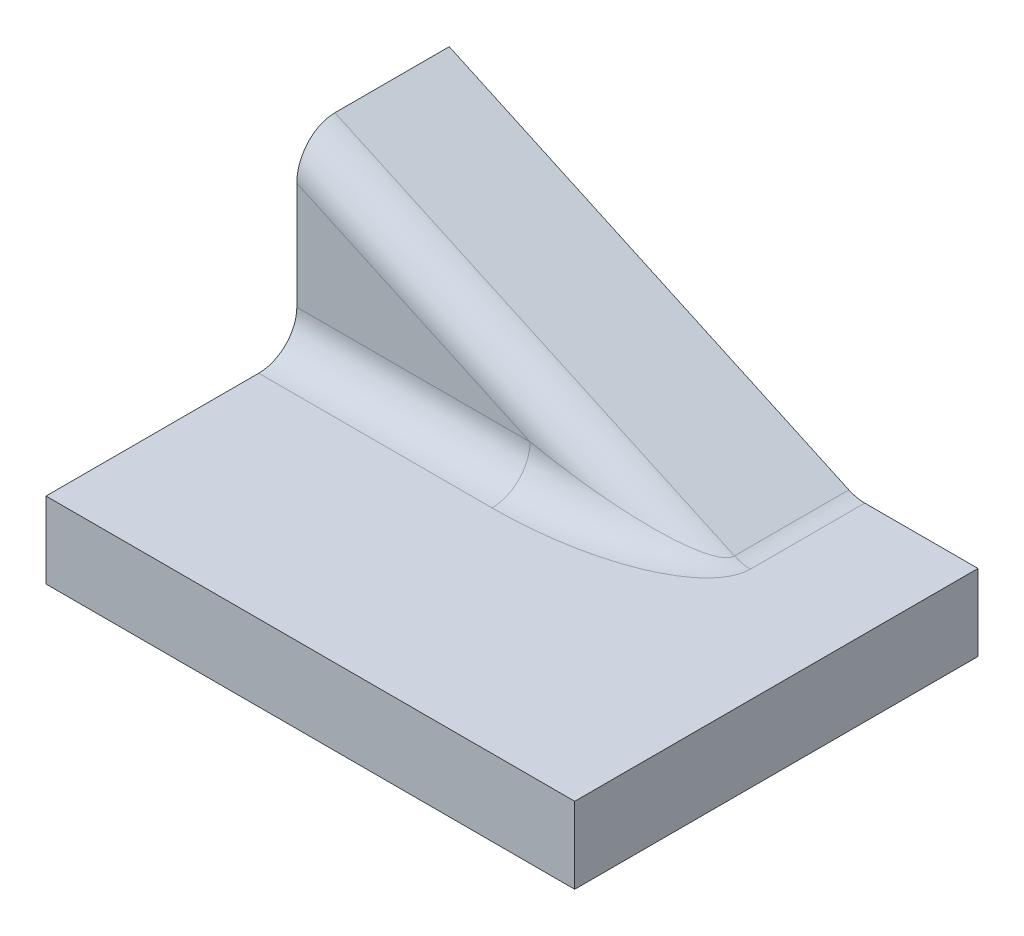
ISO-10303-21;
HEADER;
FILE_DESCRIPTION(('STEP AP214'),'2;1');
FILE_NAME('part.step','',(''),(''),'','','');
FILE_SCHEMA(('AUTOMOTIVE_DESIGN { 1 0 10303 214 1 1 1 1 }'));
ENDSEC;
DATA;
#1=APPLICATION_CONTEXT('core data for automotive mechanical design processes');
#2=APPLICATION_PROTOCOL_DEFINITION('international standard','automotive_design',2000,#1);
#3=PRODUCT_CONTEXT('',#1,'mechanical');
#4=PRODUCT('Part','Part','',(#3));
#5=PRODUCT_RELATED_PRODUCT_CATEGORY('part','',(#4));
#6=PRODUCT_DEFINITION_FORMATION('','',#4);
#7=PRODUCT_DEFINITION_CONTEXT('part definition',#1,'design');
#8=PRODUCT_DEFINITION('design','',#6,#7);
#9=PRODUCT_DEFINITION_SHAPE('','',#8);
#10=(LENGTH_UNIT() NAMED_UNIT(*) SI_UNIT(.MILLI.,.METRE.));
#11=(NAMED_UNIT(*) PLANE_ANGLE_UNIT() SI_UNIT($,.RADIAN.));
#12=(NAMED_UNIT(*) SI_UNIT($,.STERADIAN.) SOLID_ANGLE_UNIT());
#13=UNCERTAINTY_MEASURE_WITH_UNIT(LENGTH_MEASURE(1.E-05),#10,'distance_accuracy_value','');
#14=(GEOMETRIC_REPRESENTATION_CONTEXT(3) GLOBAL_UNCERTAINTY_ASSIGNED_CONTEXT((#13)) GLOBAL_UNIT_ASSIGNED_CONTEXT((#10,
#11,#12)) REPRESENTATION_CONTEXT('',''));
#15=CARTESIAN_POINT('',(0.,0.,0.));
#16=DIRECTION('',(0.,0.,1.));
#17=DIRECTION('',(1.,0.,0.));
#18=AXIS2_PLACEMENT_3D('',#15,#16,#17);
#19=CARTESIAN_POINT('',(0.,25.4,0.));
#20=DIRECTION('',(0.,-1.,0.));
#21=DIRECTION('',(0.,0.,-1.));
#22=AXIS2_PLACEMENT_3D('',#19,#20,#21);
#23=PLANE('',#22);
#24=DIRECTION('',(-1.,0.,0.));
#25=VECTOR('',#24,1.);
#26=CARTESIAN_POINT('',(-88.0843898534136,25.4,-67.1830092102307));
#27=LINE('',#26,#25);
#28=CARTESIAN_POINT('',(88.0843898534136,25.4,-67.1830092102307));
#29=VERTEX_POINT('',#28);
#30=CARTESIAN_POINT('',(50.3632623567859,25.4,-67.1830092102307));
#31=VERTEX_POINT('',#30);
#32=EDGE_CURVE('E161',#29,#31,#27,.T.);
#33=ORIENTED_EDGE('',*,*,#32,.T.);
#34=DIRECTION('',(0.,0.,-1.));
#35=VECTOR('',#34,1.);
#36=CARTESIAN_POINT('',(50.363262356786,25.4,0.));
#37=LINE('',#36,#35);
#38=CARTESIAN_POINT('',(50.363262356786,25.4,-29.0830092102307));
#39=VERTEX_POINT('',#38);
#40=EDGE_CURVE('E201',#31,#39,#37,.F.);
#41=ORIENTED_EDGE('',*,*,#40,.T.);
#42=CARTESIAN_POINT('',(-10.3596540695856,25.4,-29.0830092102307));
#43=DIRECTION('',(0.,-1.,0.));
#44=DIRECTION('',(-1.,0.,0.));
#45=AXIS2_PLACEMENT_3D('',#42,#43,#44);
#46=ELLIPSE('',#45,60.7229164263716,25.4);
#47=CARTESIAN_POINT('',(-10.3596540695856,25.4,-3.68300921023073));
#48=VERTEX_POINT('',#47);
#49=EDGE_CURVE('E205',#39,#48,#46,.T.);
#50=ORIENTED_EDGE('',*,*,#49,.T.);
#51=DIRECTION('',(-1.,0.,0.));
#52=VECTOR('',#51,1.);
#53=CARTESIAN_POINT('',(-88.0843898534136,25.4,-3.68300921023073));
#54=LINE('',#53,#52);
#55=CARTESIAN_POINT('',(-88.0843898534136,25.4,-3.68300921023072));
#56=VERTEX_POINT('',#55);
#57=EDGE_CURVE('E156',#48,#56,#54,.T.);
#58=ORIENTED_EDGE('',*,*,#57,.T.);
#59=DIRECTION('',(0.,0.,1.));
#60=VECTOR('',#59,1.);
#61=CARTESIAN_POINT('',(-88.0843898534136,25.4,67.1830092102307));
#62=LINE('',#61,#60);
#63=CARTESIAN_POINT('',(-88.0843898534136,25.4,67.1830092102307));
#64=VERTEX_POINT('',#63);
#65=EDGE_CURVE('E157',#56,#64,#62,.T.);
#66=ORIENTED_EDGE('',*,*,#65,.T.);
#67=DIRECTION('',(1.,0.,0.));
#68=VECTOR('',#67,1.);
#69=CARTESIAN_POINT('',(-88.0843898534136,25.4,67.1830092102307));
#70=LINE('',#69,#68);
#71=CARTESIAN_POINT('',(88.0843898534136,25.4,67.1830092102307));
#72=VERTEX_POINT('',#71);
#73=EDGE_CURVE('E160',#64,#72,#70,.T.);
#74=ORIENTED_EDGE('',*,*,#73,.T.);
#75=DIRECTION('',(0.,0.,-1.));
#76=VECTOR('',#75,1.);
#77=CARTESIAN_POINT('',(88.0843898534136,25.4,67.1830092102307));
#78=LINE('',#77,#76);
#79=EDGE_CURVE('E177',#72,#29,#78,.T.);
#80=ORIENTED_EDGE('',*,*,#79,.T.);
#81=EDGE_LOOP('',(#33,#41,#50,#58,#66,#74,#80));
#82=FACE_BOUND('',#81,.T.);
#83=ADVANCED_FACE('F36',(#82),#23,.F.);
#84=CARTESIAN_POINT('',(88.0843898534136,25.4,67.1830092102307));
#85=DIRECTION('',(-1.,0.,0.));
#86=DIRECTION('',(0.,0.,1.));
#87=AXIS2_PLACEMENT_3D('',#84,#85,#86);
#88=PLANE('',#87);
#89=DIRECTION('',(0.,0.,-1.));
#90=VECTOR('',#89,1.);
#91=CARTESIAN_POINT('',(88.0843898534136,0.,67.1830092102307));
#92=LINE('',#91,#90);
#93=CARTESIAN_POINT('',(88.0843898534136,0.,67.1830092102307));
#94=VERTEX_POINT('',#93);
#95=CARTESIAN_POINT('',(88.0843898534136,0.,-67.1830092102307));
#96=VERTEX_POINT('',#95);
#97=EDGE_CURVE('E123',#94,#96,#92,.T.);
#98=ORIENTED_EDGE('',*,*,#97,.T.);
#99=DIRECTION('',(0.,-1.,0.));
#100=VECTOR('',#99,1.);
#101=CARTESIAN_POINT('',(88.0843898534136,25.4,-67.1830092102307));
#102=LINE('',#101,#100);
#103=EDGE_CURVE('E132',#29,#96,#102,.T.);
#104=ORIENTED_EDGE('',*,*,#103,.F.);
#105=ORIENTED_EDGE('',*,*,#79,.F.);
#106=DIRECTION('',(0.,-1.,0.));
#107=VECTOR('',#106,1.);
#108=CARTESIAN_POINT('',(88.0843898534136,25.4,67.1830092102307));
#109=LINE('',#108,#107);
#110=EDGE_CURVE('E169',#72,#94,#109,.T.);
#111=ORIENTED_EDGE('',*,*,#110,.T.);
#112=EDGE_LOOP('',(#98,#104,#105,#111));
#113=FACE_BOUND('',#112,.T.);
#114=ADVANCED_FACE('F191',(#113),#88,.F.);
#115=CARTESIAN_POINT('',(-88.0843898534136,25.4,-67.1830092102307));
#116=DIRECTION('',(0.,0.,1.));
#117=DIRECTION('',(1.,0.,0.));
#118=AXIS2_PLACEMENT_3D('',#115,#116,#117);
#119=PLANE('',#118);
#120=DIRECTION('',(-1.,0.,0.));
#121=VECTOR('',#120,1.);
#122=CARTESIAN_POINT('',(-88.0843898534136,0.,-67.1830092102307));
#123=LINE('',#122,#121);
#124=CARTESIAN_POINT('',(-88.0843898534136,0.,-67.1830092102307));
#125=VERTEX_POINT('',#124);
#126=EDGE_CURVE('E131',#96,#125,#123,.T.);
#127=ORIENTED_EDGE('',*,*,#126,.T.);
#128=DIRECTION('',(0.,-1.,0.));
#129=VECTOR('',#128,1.);
#130=CARTESIAN_POINT('',(-88.0843898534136,25.4,-67.1830092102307));
#131=LINE('',#130,#129);
#132=CARTESIAN_POINT('',(-88.0843898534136,87.8755766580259,-67.1830092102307));
#133=VERTEX_POINT('',#132);
#134=EDGE_CURVE('E115',#133,#125,#131,.T.);
#135=ORIENTED_EDGE('',*,*,#134,.F.);
#136=DIRECTION('',(0.908311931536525,-0.418293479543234,0.));
#137=VECTOR('',#136,1.);
#138=CARTESIAN_POINT('',(47.5794788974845,25.4,-67.1830092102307));
#139=LINE('',#138,#137);
#140=CARTESIAN_POINT('',(45.0509351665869,26.5644384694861,-67.1830092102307));
#141=VERTEX_POINT('',#140);
#142=EDGE_CURVE('E129',#133,#141,#139,.T.);
#143=ORIENTED_EDGE('',*,*,#142,.T.);
#144=CARTESIAN_POINT('',(50.363262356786,38.1,-67.1830092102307));
#145=DIRECTION('',(0.,0.,1.));
#146=DIRECTION('',(1.,0.,0.));
#147=AXIS2_PLACEMENT_3D('',#144,#145,#146);
#148=CIRCLE('',#147,12.7);
#149=EDGE_CURVE('E49',#141,#31,#148,.T.);
#150=ORIENTED_EDGE('',*,*,#149,.T.);
#151=ORIENTED_EDGE('',*,*,#32,.F.);
#152=ORIENTED_EDGE('',*,*,#103,.T.);
#153=EDGE_LOOP('',(#127,#135,#143,#150,#151,#152));
#154=FACE_BOUND('',#153,.T.);
#155=ADVANCED_FACE('F128',(#154),#119,.F.);
#156=CARTESIAN_POINT('',(-88.0843898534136,25.4,67.1830092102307));
#157=DIRECTION('',(1.,0.,0.));
#158=DIRECTION('',(0.,0.,-1.));
#159=AXIS2_PLACEMENT_3D('',#156,#157,#158);
#160=PLANE('',#159);
#161=ORIENTED_EDGE('',*,*,#65,.F.);
#162=CARTESIAN_POINT('',(-88.0843898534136,38.1,-3.68300921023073));
#163=DIRECTION('',(1.,0.,0.));
#164=DIRECTION('',(0.,0.,-1.));
#165=AXIS2_PLACEMENT_3D('',#162,#163,#164);
#166=CIRCLE('',#165,12.7);
#167=CARTESIAN_POINT('',(-88.0843898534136,38.1,-16.3830092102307));
#168=VERTEX_POINT('',#167);
#169=EDGE_CURVE('E11',#56,#168,#166,.T.);
#170=ORIENTED_EDGE('',*,*,#169,.T.);
#171=DIRECTION('',(0.,1.,0.));
#172=VECTOR('',#171,1.);
#173=CARTESIAN_POINT('',(-88.0843898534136,87.8755766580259,-16.3830092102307));
#174=LINE('',#173,#172);
#175=CARTESIAN_POINT('',(-88.0843898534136,73.8935958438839,-16.3830092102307));
#176=VERTEX_POINT('',#175);
#177=EDGE_CURVE('E124',#168,#176,#174,.T.);
#178=ORIENTED_EDGE('',*,*,#177,.T.);
#179=CARTESIAN_POINT('',(-88.0843898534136,73.8935958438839,-29.0830092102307));
#180=DIRECTION('',(1.,0.,0.));
#181=DIRECTION('',(0.,1.,0.));
#182=AXIS2_PLACEMENT_3D('',#179,#180,#181);
#183=ELLIPSE('',#182,13.981980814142,12.7);
#184=CARTESIAN_POINT('',(-88.0843898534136,87.8755766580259,-29.0830092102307));
#185=VERTEX_POINT('',#184);
#186=EDGE_CURVE('E118',#176,#185,#183,.F.);
#187=ORIENTED_EDGE('',*,*,#186,.T.);
#188=DIRECTION('',(0.,0.,-1.));
#189=VECTOR('',#188,1.);
#190=CARTESIAN_POINT('',(-88.0843898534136,87.8755766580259,-16.3830092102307));
#191=LINE('',#190,#189);
#192=EDGE_CURVE('E112',#185,#133,#191,.T.);
#193=ORIENTED_EDGE('',*,*,#192,.T.);
#194=ORIENTED_EDGE('',*,*,#134,.T.);
#195=DIRECTION('',(0.,0.,1.));
#196=VECTOR('',#195,1.);
#197=CARTESIAN_POINT('',(-88.0843898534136,0.,67.1830092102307));
#198=LINE('',#197,#196);
#199=CARTESIAN_POINT('',(-88.0843898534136,0.,67.1830092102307));
#200=VERTEX_POINT('',#199);
#201=EDGE_CURVE('E173',#125,#200,#198,.T.);
#202=ORIENTED_EDGE('',*,*,#201,.T.);
#203=DIRECTION('',(0.,-1.,0.));
#204=VECTOR('',#203,1.);
#205=CARTESIAN_POINT('',(-88.0843898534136,25.4,67.1830092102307));
#206=LINE('',#205,#204);
#207=EDGE_CURVE('E133',#64,#200,#206,.T.);
#208=ORIENTED_EDGE('',*,*,#207,.F.);
#209=EDGE_LOOP('',(#161,#170,#178,#187,#193,#194,#202,#208));
#210=FACE_BOUND('',#209,.T.);
#211=ADVANCED_FACE('F114',(#210),#160,.F.);
#212=CARTESIAN_POINT('',(-88.0843898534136,25.4,67.1830092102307));
#213=DIRECTION('',(0.,0.,-1.));
#214=DIRECTION('',(-1.,0.,0.));
#215=AXIS2_PLACEMENT_3D('',#212,#213,#214);
#216=PLANE('',#215);
#217=DIRECTION('',(1.,0.,0.));
#218=VECTOR('',#217,1.);
#219=CARTESIAN_POINT('',(-88.0843898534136,0.,67.1830092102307));
#220=LINE('',#219,#218);
#221=EDGE_CURVE('E175',#200,#94,#220,.T.);
#222=ORIENTED_EDGE('',*,*,#221,.T.);
#223=ORIENTED_EDGE('',*,*,#110,.F.);
#224=ORIENTED_EDGE('',*,*,#73,.F.);
#225=ORIENTED_EDGE('',*,*,#207,.T.);
#226=EDGE_LOOP('',(#222,#223,#224,#225));
#227=FACE_BOUND('',#226,.T.);
#228=ADVANCED_FACE('F217',(#227),#216,.F.);
#229=CARTESIAN_POINT('',(0.,0.,0.));
#230=DIRECTION('',(0.,-1.,0.));
#231=DIRECTION('',(0.,0.,-1.));
#232=AXIS2_PLACEMENT_3D('',#229,#230,#231);
#233=PLANE('',#232);
#234=ORIENTED_EDGE('',*,*,#97,.F.);
#235=ORIENTED_EDGE('',*,*,#221,.F.);
#236=ORIENTED_EDGE('',*,*,#201,.F.);
#237=ORIENTED_EDGE('',*,*,#126,.F.);
#238=EDGE_LOOP('',(#234,#235,#236,#237));
#239=FACE_BOUND('',#238,.T.);
#240=ADVANCED_FACE('F219',(#239),#233,.T.);
#241=CARTESIAN_POINT('',(47.5794788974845,25.4,-16.3830092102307));
#242=DIRECTION('',(0.418293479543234,0.908311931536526,0.));
#243=DIRECTION('',(-0.908311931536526,0.418293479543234,0.));
#244=AXIS2_PLACEMENT_3D('',#241,#242,#243);
#245=PLANE('',#244);
#246=DIRECTION('',(0.908311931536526,-0.418293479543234,0.));
#247=VECTOR('',#246,1.);
#248=CARTESIAN_POINT('',(47.5794788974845,25.4,-29.0830092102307));
#249=LINE('',#248,#247);
#250=CARTESIAN_POINT('',(45.0509351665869,26.5644384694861,-29.0830092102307));
#251=VERTEX_POINT('',#250);
#252=EDGE_CURVE('E150',#185,#251,#249,.T.);
#253=ORIENTED_EDGE('',*,*,#252,.T.);
#254=DIRECTION('',(0.,0.,-1.));
#255=VECTOR('',#254,1.);
#256=CARTESIAN_POINT('',(45.0509351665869,26.5644384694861,-16.3830092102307));
#257=LINE('',#256,#255);
#258=EDGE_CURVE('E138',#251,#141,#257,.T.);
#259=ORIENTED_EDGE('',*,*,#258,.T.);
#260=ORIENTED_EDGE('',*,*,#142,.F.);
#261=ORIENTED_EDGE('',*,*,#192,.F.);
#262=EDGE_LOOP('',(#253,#259,#260,#261));
#263=FACE_BOUND('',#262,.T.);
#264=ADVANCED_FACE('F136',(#263),#245,.T.);
#265=CARTESIAN_POINT('',(0.,0.,-16.3830092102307));
#266=DIRECTION('',(0.,0.,-1.));
#267=DIRECTION('',(-1.,0.,0.));
#268=AXIS2_PLACEMENT_3D('',#265,#266,#267);
#269=PLANE('',#268);
#270=ORIENTED_EDGE('',*,*,#177,.F.);
#271=DIRECTION('',(-1.,0.,0.));
#272=VECTOR('',#271,1.);
#273=CARTESIAN_POINT('',(17.2180206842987,38.1,-16.3830092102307));
#274=LINE('',#273,#272);
#275=CARTESIAN_POINT('',(-10.3596540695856,38.1,-16.3830092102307));
#276=VERTEX_POINT('',#275);
#277=EDGE_CURVE('E62',#168,#276,#274,.F.);
#278=ORIENTED_EDGE('',*,*,#277,.T.);
#279=DIRECTION('',(0.908311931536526,-0.418293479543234,0.));
#280=VECTOR('',#279,1.);
#281=CARTESIAN_POINT('',(-93.3967170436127,76.3400151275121,-16.3830092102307));
#282=LINE('',#281,#280);
#283=EDGE_CURVE('E152',#276,#176,#282,.F.);
#284=ORIENTED_EDGE('',*,*,#283,.T.);
#285=EDGE_LOOP('',(#270,#278,#284));
#286=FACE_BOUND('',#285,.T.);
#287=ADVANCED_FACE('F226',(#286),#269,.F.);
#288=CARTESIAN_POINT('',(42.2671517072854,13.8644384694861,-29.0830092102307));
#289=DIRECTION('',(-0.908311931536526,0.418293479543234,0.));
#290=DIRECTION('',(-0.418293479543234,-0.908311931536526,0.));
#291=AXIS2_PLACEMENT_3D('',#288,#289,#290);
#292=CYLINDRICAL_SURFACE('',#291,12.7);
#293=ORIENTED_EDGE('',*,*,#283,.F.);
#294=CARTESIAN_POINT('',(-10.3596540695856,38.1,-29.0830092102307));
#295=DIRECTION('',(0.203813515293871,0.979009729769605,0.));
#296=DIRECTION('',(-0.979009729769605,0.203813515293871,0.));
#297=AXIS2_PLACEMENT_3D('',#294,#295,#296);
#298=ELLIPSE('',#297,56.5986093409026,12.7);
#299=EDGE_CURVE('E195',#276,#251,#298,.T.);
#300=ORIENTED_EDGE('',*,*,#299,.T.);
#301=ORIENTED_EDGE('',*,*,#252,.F.);
#302=ORIENTED_EDGE('',*,*,#186,.F.);
#303=EDGE_LOOP('',(#293,#300,#301,#302));
#304=FACE_BOUND('',#303,.T.);
#305=ADVANCED_FACE('F211',(#304),#292,.T.);
#306=CARTESIAN_POINT('',(0.,38.1,-3.68300921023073));
#307=DIRECTION('',(1.,0.,0.));
#308=DIRECTION('',(0.,0.,-1.));
#309=AXIS2_PLACEMENT_3D('',#306,#307,#308);
#310=CYLINDRICAL_SURFACE('',#309,12.7);
#311=ORIENTED_EDGE('',*,*,#169,.F.);
#312=ORIENTED_EDGE('',*,*,#57,.F.);
#313=CARTESIAN_POINT('',(-10.3596540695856,38.1,-3.68300921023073));
#314=DIRECTION('',(-1.,0.,0.));
#315=DIRECTION('',(0.,-1.,0.));
#316=AXIS2_PLACEMENT_3D('',#313,#314,#315);
#317=CIRCLE('',#316,12.7);
#318=EDGE_CURVE('E139',#276,#48,#317,.T.);
#319=ORIENTED_EDGE('',*,*,#318,.F.);
#320=ORIENTED_EDGE('',*,*,#277,.F.);
#321=EDGE_LOOP('',(#311,#312,#319,#320));
#322=FACE_BOUND('',#321,.T.);
#323=ADVANCED_FACE('F213',(#322),#310,.F.);
#324=CARTESIAN_POINT('',(-65.0226761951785,49.4799305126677,-27.0038983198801));
#325=CARTESIAN_POINT('',(-56.6353878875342,45.0095108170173,-30.3313636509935));
#326=CARTESIAN_POINT('',(-58.769254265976,35.2047554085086,-29.4848008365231));
#327=CARTESIAN_POINT('',(-60.9031206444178,25.4,-28.6382380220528));
#328=CARTESIAN_POINT('',(-70.2633325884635,25.4,-24.9247874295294));
#329=CARTESIAN_POINT('',(-64.9618233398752,49.4672619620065,-26.9198482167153));
#330=CARTESIAN_POINT('',(-56.6409402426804,44.9817366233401,-30.3592086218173));
#331=CARTESIAN_POINT('',(-58.7705335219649,35.1908619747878,-29.4791893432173));
#332=CARTESIAN_POINT('',(-60.9001237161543,25.4,-28.5991740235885));
#333=CARTESIAN_POINT('',(-70.1966456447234,25.4,-24.7566872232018));
#334=CARTESIAN_POINT('',(-64.8976949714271,49.4539115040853,-26.8365185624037));
#335=CARTESIAN_POINT('',(-56.6453624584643,44.9526591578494,-30.3830992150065));
#336=CARTESIAN_POINT('',(-58.7704726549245,35.1763222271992,-29.4700262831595));
#337=CARTESIAN_POINT('',(-60.8955839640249,25.4,-28.5569652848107));
#338=CARTESIAN_POINT('',(-70.1263691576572,25.4,-24.5900279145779));
#339=CARTESIAN_POINT('',(-64.7632809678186,49.4259287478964,-26.6713818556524));
#340=CARTESIAN_POINT('',(-56.6513090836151,44.8921960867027,-30.4230849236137));
#341=CARTESIAN_POINT('',(-58.7670872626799,35.1460907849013,-29.4447877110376));
#342=CARTESIAN_POINT('',(-60.8828676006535,25.4,-28.4665029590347));
#343=CARTESIAN_POINT('',(-69.9790686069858,25.4,-24.2597545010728));
#344=CARTESIAN_POINT('',(-64.6929965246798,49.4112966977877,-26.5895745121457));
#345=CARTESIAN_POINT('',(-56.6528366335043,44.8608153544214,-30.4391876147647));
#346=CARTESIAN_POINT('',(-58.7637633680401,35.1303993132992,-29.4287135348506));
#347=CARTESIAN_POINT('',(-60.8746956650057,25.4,-28.4182596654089));
#348=CARTESIAN_POINT('',(-69.9020458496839,25.4,-24.0961398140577));
#349=CARTESIAN_POINT('',(-64.5467355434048,49.3808475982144,-26.4276370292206));
#350=CARTESIAN_POINT('',(-56.6523730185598,44.7960581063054,-30.463745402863));
#351=CARTESIAN_POINT('',(-58.7532762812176,35.0980207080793,-29.3898663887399));
#352=CARTESIAN_POINT('',(-60.8541848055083,25.4,-28.3160072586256));
#353=CARTESIAN_POINT('',(-69.7417625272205,25.4,-23.7722648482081));
#354=CARTESIAN_POINT('',(-64.4707665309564,49.3650321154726,-26.3475048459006));
#355=CARTESIAN_POINT('',(-56.6503900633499,44.7626884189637,-30.472217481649));
#356=CARTESIAN_POINT('',(-58.7461180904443,35.0813348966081,-29.3671021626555));
#357=CARTESIAN_POINT('',(-60.8418562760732,25.4,-28.262015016));
#358=CARTESIAN_POINT('',(-69.65851020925,25.4,-23.6120004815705));
#359=CARTESIAN_POINT('',(-64.3134291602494,49.3322770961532,-26.1888487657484));
#360=CARTESIAN_POINT('',(-56.6424318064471,44.6941741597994,-30.4818792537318));
#361=CARTESIAN_POINT('',(-58.7275219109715,35.0470777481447,-29.3152128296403));
#362=CARTESIAN_POINT('',(-60.812622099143,25.4,-28.1485747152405));
#363=CARTESIAN_POINT('',(-69.4860885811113,25.4,-23.2946883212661));
#364=CARTESIAN_POINT('',(-64.232060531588,49.3153375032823,-26.1103249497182));
#365=CARTESIAN_POINT('',(-56.636460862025,44.6590332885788,-30.4830762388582));
#366=CARTESIAN_POINT('',(-58.7160837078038,35.0295063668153,-29.2860874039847));
#367=CARTESIAN_POINT('',(-60.7957219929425,25.4,-28.0891353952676));
#368=CARTESIAN_POINT('',(-69.3969189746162,25.4,-23.1376406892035));
#369=CARTESIAN_POINT('',(-63.9815764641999,49.2631908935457,-25.8783001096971));
#370=CARTESIAN_POINT('',(-56.6120744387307,44.5518787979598,-30.4763693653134));
#371=CARTESIAN_POINT('',(-58.6749828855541,34.9758993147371,-29.1902242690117));
#372=CARTESIAN_POINT('',(-60.7379534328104,25.4,-27.9042223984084));
#373=CARTESIAN_POINT('',(-69.1224204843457,25.4,-22.6735910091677));
#374=CARTESIAN_POINT('',(-63.8050285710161,49.2264365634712,-25.7271897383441));
#375=CARTESIAN_POINT('',(-56.587198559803,44.4775643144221,-30.4583712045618));
#376=CARTESIAN_POINT('',(-58.6384699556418,34.9387361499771,-29.1147109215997));
#377=CARTESIAN_POINT('',(-60.6898539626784,25.4,-27.7712564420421));
#378=CARTESIAN_POINT('',(-68.9289465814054,25.4,-22.3713702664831));
#379=CARTESIAN_POINT('',(-63.4346675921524,49.1493335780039,-25.4314354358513));
#380=CARTESIAN_POINT('',(-56.5181491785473,44.3245388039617,-30.3989478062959));
#381=CARTESIAN_POINT('',(-58.5454264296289,34.8622233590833,-28.9439020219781));
#382=CARTESIAN_POINT('',(-60.5728149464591,25.4,-27.4890614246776));
#383=CARTESIAN_POINT('',(-68.5230783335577,25.4,-21.7798616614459));
#384=CARTESIAN_POINT('',(-63.2408484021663,49.1089836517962,-25.2867938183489));
#385=CARTESIAN_POINT('',(-56.4740195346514,44.2458464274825,-30.3575742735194));
#386=CARTESIAN_POINT('',(-58.4888887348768,34.8228729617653,-28.848599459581));
#387=CARTESIAN_POINT('',(-60.503925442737,25.4,-27.339883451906));
#388=CARTESIAN_POINT('',(-68.310677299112,25.4,-21.4905784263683));
#389=CARTESIAN_POINT('',(-62.8432500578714,49.0262103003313,-25.0073642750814));
#390=CARTESIAN_POINT('',(-56.3671828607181,44.087392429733,-30.2566487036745));
#391=CARTESIAN_POINT('',(-58.3570399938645,34.7436484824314,-28.6446191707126));
#392=CARTESIAN_POINT('',(-60.3470557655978,25.4,-27.0328353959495));
#393=CARTESIAN_POINT('',(-67.8749603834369,25.4,-20.9317193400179));
#394=CARTESIAN_POINT('',(-62.6398317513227,48.9838619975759,-24.8724216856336));
#395=CARTESIAN_POINT('',(-56.3050121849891,44.0077225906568,-30.1976200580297));
#396=CARTESIAN_POINT('',(-58.2822233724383,34.7038109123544,-28.5363267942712));
#397=CARTESIAN_POINT('',(-60.2596455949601,25.4,-26.8753190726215));
#398=CARTESIAN_POINT('',(-67.6520399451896,25.4,-20.6618341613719));
#399=CARTESIAN_POINT('',(-62.2207295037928,48.8966118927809,-24.6084323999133));
#400=CARTESIAN_POINT('',(-56.1619849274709,43.8465002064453,-30.0645646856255));
#401=CARTESIAN_POINT('',(-58.1135710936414,34.6231998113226,-28.3079238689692));
#402=CARTESIAN_POINT('',(-60.0653674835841,25.4,-26.551568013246));
#403=CARTESIAN_POINT('',(-67.1927575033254,25.4,-20.1338555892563));
#404=CARTESIAN_POINT('',(-62.0050470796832,48.8517104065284,-24.4793849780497));
#405=CARTESIAN_POINT('',(-56.0811807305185,43.7649565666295,-29.9905804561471));
#406=CARTESIAN_POINT('',(-58.0197377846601,34.5824263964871,-28.1878147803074));
#407=CARTESIAN_POINT('',(-59.9585552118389,25.4,-26.3853640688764));
#408=CARTESIAN_POINT('',(-66.9563971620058,25.4,-19.8757607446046));
#409=CARTESIAN_POINT('',(-61.5625498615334,48.7595898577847,-24.2266568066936));
#410=CARTESIAN_POINT('',(-55.9014476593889,43.6005770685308,-29.8305318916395));
#411=CARTESIAN_POINT('',(-57.8137020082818,34.5002365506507,-27.9383984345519));
#412=CARTESIAN_POINT('',(-59.726216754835,25.4,-26.0465804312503));
#413=CARTESIAN_POINT('',(-66.4714768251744,25.4,-19.3703044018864));
#414=CARTESIAN_POINT('',(-61.3357130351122,48.7123662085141,-24.1029876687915));
#415=CARTESIAN_POINT('',(-55.8025289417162,43.5177433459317,-29.7444747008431));
#416=CARTESIAN_POINT('',(-57.7014620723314,34.4588189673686,-27.8090727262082));
#417=CARTESIAN_POINT('',(-59.6007014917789,25.4,-25.8740068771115));
#418=CARTESIAN_POINT('',(-66.2228926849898,25.4,-19.1229661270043));
#419=CARTESIAN_POINT('',(-60.8726915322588,48.6159728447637,-23.8610210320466));
#420=CARTESIAN_POINT('',(-55.58772621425,43.3515348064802,-29.563032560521));
#421=CARTESIAN_POINT('',(-57.4598877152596,34.3757147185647,-27.5438726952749));
#422=CARTESIAN_POINT('',(-59.3323556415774,25.4,-25.5250493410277));
#423=CARTESIAN_POINT('',(-65.7154803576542,25.4,-18.6390328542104));
#424=CARTESIAN_POINT('',(-60.6365061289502,48.5668029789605,-23.7427239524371));
#425=CARTESIAN_POINT('',(-55.471884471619,43.2681618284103,-29.4676710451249));
#426=CARTESIAN_POINT('',(-57.3305519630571,34.3340280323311,-27.4079978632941));
#427=CARTESIAN_POINT('',(-59.1895683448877,25.4,-25.3486757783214));
#428=CARTESIAN_POINT('',(-65.4566513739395,25.4,-18.402438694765));
#429=CARTESIAN_POINT('',(-59.9968535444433,48.4336379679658,-23.4345590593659));
#430=CARTESIAN_POINT('',(-55.1427418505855,43.0462722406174,-29.20458281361));
#431=CARTESIAN_POINT('',(-56.9651351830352,34.2229910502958,-27.0402679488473));
#432=CARTESIAN_POINT('',(-58.7884819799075,25.4,-24.8769125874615));
#433=CARTESIAN_POINT('',(-64.7556739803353,25.4,-17.786108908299));
#434=CARTESIAN_POINT('',(-59.5861791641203,48.348142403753,-23.2491699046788));
#435=CARTESIAN_POINT('',(-54.9153854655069,42.9074885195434,-29.0304490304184));
#436=CARTESIAN_POINT('',(-56.7150811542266,34.1536014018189,-26.8044355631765));
#437=CARTESIAN_POINT('',(-58.5158896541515,25.4,-24.5794075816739));
#438=CARTESIAN_POINT('',(-64.305627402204,25.4,-17.415330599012));
#439=CARTESIAN_POINT('',(-58.746645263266,48.173365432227,-22.8911881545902));
#440=CARTESIAN_POINT('',(-54.4225885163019,42.6310965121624,-28.6704459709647));
#441=CARTESIAN_POINT('',(-56.177012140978,34.015405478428,-26.3273232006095));
#442=CARTESIAN_POINT('',(-57.9325472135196,25.4,-23.9851872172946));
#443=CARTESIAN_POINT('',(-63.3856056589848,25.4,-16.6993670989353));
#444=CARTESIAN_POINT('',(-58.3177814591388,48.0840831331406,-22.7185986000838));
#445=CARTESIAN_POINT('',(-54.1572802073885,42.4934749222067,-28.4846108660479));
#446=CARTESIAN_POINT('',(-55.8889881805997,33.946599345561,-26.0860419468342));
#447=CARTESIAN_POINT('',(-57.621926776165,25.4,-23.6884500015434));
#448=CARTESIAN_POINT('',(-62.9156257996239,25.4,-16.3541879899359));
#449=CARTESIAN_POINT('',(-57.445173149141,47.902420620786,-22.3850624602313));
#450=CARTESIAN_POINT('',(-53.593813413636,42.2202293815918,-28.1066769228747));
#451=CARTESIAN_POINT('',(-55.2803260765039,33.8099770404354,-25.6027348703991));
#452=CARTESIAN_POINT('',(-56.9680652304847,25.4,-23.0997669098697));
#453=CARTESIAN_POINT('',(-61.9593587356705,25.4,-15.6871157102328));
#454=CARTESIAN_POINT('',(-57.0014261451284,47.8100398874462,-22.2241178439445));
#455=CARTESIAN_POINT('',(-53.2957576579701,42.0845861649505,-27.9145862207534));
#456=CARTESIAN_POINT('',(-54.9596824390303,33.7421610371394,-25.3607089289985));
#457=CARTESIAN_POINT('',(-56.6249221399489,25.4,-22.8077776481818));
#458=CARTESIAN_POINT('',(-61.4730687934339,25.4,-15.3652264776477));
#459=CARTESIAN_POINT('',(-56.1017445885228,47.6227411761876,-21.9128901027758));
#460=CARTESIAN_POINT('',(-52.6714684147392,41.8158077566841,-27.5280321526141));
#461=CARTESIAN_POINT('',(-54.2905254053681,33.6077722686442,-24.8791631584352));
#462=CARTESIAN_POINT('',(-55.9108930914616,25.4,-22.231237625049));
#463=CARTESIAN_POINT('',(-60.4871329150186,25.4,-14.7427709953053));
#464=CARTESIAN_POINT('',(-55.645810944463,47.5278233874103,-21.7626061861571));
#465=CARTESIAN_POINT('',(-52.345317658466,41.6826498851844,-27.3335599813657));
#466=CARTESIAN_POINT('',(-53.9420140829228,33.5411994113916,-24.6396431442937));
#467=CARTESIAN_POINT('',(-55.5400838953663,25.4,-21.9466300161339));
#468=CARTESIAN_POINT('',(-59.987487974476,25.4,-14.4422031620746));
#469=CARTESIAN_POINT('',(-54.7165953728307,47.334376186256,-21.4695290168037));
#470=CARTESIAN_POINT('',(-51.6635331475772,41.4170411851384,-26.9418918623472));
#471=CARTESIAN_POINT('',(-53.2154844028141,33.4083915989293,-24.1615204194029));
#472=CARTESIAN_POINT('',(-54.7688470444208,25.4,-21.3820779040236));
#473=CARTESIAN_POINT('',(-58.9691865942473,25.4,-13.8560488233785));
#474=CARTESIAN_POINT('',(-54.2431541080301,47.2358136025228,-21.3268878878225));
#475=CARTESIAN_POINT('',(-51.3075609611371,41.2846008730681,-26.7446674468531));
#476=CARTESIAN_POINT('',(-52.8370925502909,33.3421778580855,-23.922989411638));
#477=CARTESIAN_POINT('',(-54.3680801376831,25.4,-21.1021926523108));
#478=CARTESIAN_POINT('',(-58.4503555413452,25.4,-13.57076656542));
#479=CARTESIAN_POINT('',(-53.287416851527,47.0368450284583,-21.0508299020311));
#480=CARTESIAN_POINT('',(-50.5740650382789,41.022652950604,-26.3524302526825));
#481=CARTESIAN_POINT('',(-52.0591239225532,33.2112043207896,-23.4520980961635));
#482=CARTESIAN_POINT('',(-53.5456341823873,25.4,-20.5526444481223));
#483=CARTESIAN_POINT('',(-57.4029897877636,25.4,-13.0186505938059));
#484=CARTESIAN_POINT('',(-52.8051207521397,46.9364390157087,-20.9174131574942));
#485=CARTESIAN_POINT('',(-50.196583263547,40.8931208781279,-26.15738893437));
#486=CARTESIAN_POINT('',(-51.659546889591,33.1464445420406,-23.2197378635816));
#487=CARTESIAN_POINT('',(-53.123990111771,25.4,-20.2829150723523));
#488=CARTESIAN_POINT('',(-56.8744549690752,25.4,-12.7518171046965));
#489=CARTESIAN_POINT('',(-51.8331545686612,46.7340918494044,-20.6591285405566));
#490=CARTESIAN_POINT('',(-49.4230886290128,40.6370395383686,-25.7708985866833));
#491=CARTESIAN_POINT('',(-50.8422385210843,33.0184043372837,-22.7621633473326));
#492=CARTESIAN_POINT('',(-52.2628620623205,25.4,-19.7542532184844));
#493=CARTESIAN_POINT('',(-55.809304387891,25.4,-12.2352478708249));
#494=CARTESIAN_POINT('',(-51.3434866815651,46.6321511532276,-20.5342581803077));
#495=CARTESIAN_POINT('',(-49.0271094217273,40.5104659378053,-25.579416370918));
#496=CARTESIAN_POINT('',(-50.4245125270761,32.9551234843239,-22.5369469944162));
#497=CARTESIAN_POINT('',(-51.8234046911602,25.4,-19.4952524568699));
#498=CARTESIAN_POINT('',(-55.2726910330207,25.4,-11.9855071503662));
#499=CARTESIAN_POINT('',(-50.3576982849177,46.4269264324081,-20.2924011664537));
#500=CARTESIAN_POINT('',(-48.2189281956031,40.2602122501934,-25.2008772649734));
#501=CARTESIAN_POINT('',(-49.5732014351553,32.8299970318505,-22.0941274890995));
#502=CARTESIAN_POINT('',(-50.9289598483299,25.4,-18.9881499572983));
#503=CARTESIAN_POINT('',(-54.1923930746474,25.4,-11.5017931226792));
#504=CARTESIAN_POINT('',(-49.8615774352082,46.3236423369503,-20.175414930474));
#505=CARTESIAN_POINT('',(-47.8067419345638,40.1365098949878,-25.0137865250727));
#506=CARTESIAN_POINT('',(-49.1396154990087,32.7681515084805,-21.8765247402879));
#507=CARTESIAN_POINT('',(-50.4739815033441,25.4,-18.7399858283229));
#508=CARTESIAN_POINT('',(-53.6487080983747,25.4,-11.2678206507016));
#509=CARTESIAN_POINT('',(-48.6033397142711,46.0616982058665,-19.8896305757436));
#510=CARTESIAN_POINT('',(-46.7502663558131,39.8283528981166,-24.5487167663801));
#511=CARTESIAN_POINT('',(-48.028691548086,32.6139376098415,-21.3377311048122));
#512=CARTESIAN_POINT('',(-49.3105545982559,25.4,-18.1284142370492));
#513=CARTESIAN_POINT('',(-52.2698405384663,25.4,-10.6962519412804));
#514=CARTESIAN_POINT('',(-47.8375593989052,45.9022755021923,-19.7256639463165));
#515=CARTESIAN_POINT('',(-46.0957400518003,39.6454181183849,-24.2735495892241));
#516=CARTESIAN_POINT('',(-47.3422614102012,32.5224884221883,-21.0217612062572));
#517=CARTESIAN_POINT('',(-48.5922136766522,25.4,-17.7714770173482));
#518=CARTESIAN_POINT('',(-51.4306432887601,25.4,-10.3683186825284));
#519=CARTESIAN_POINT('',(-46.2955935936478,45.5812639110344,-19.4131307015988));
#520=CARTESIAN_POINT('',(-44.7597066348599,39.285742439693,-23.736252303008));
#521=CARTESIAN_POINT('',(-45.9432132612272,32.3426516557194,-20.4086211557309));
#522=CARTESIAN_POINT('',(-47.1301380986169,25.4,-17.0824874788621));
#523=CARTESIAN_POINT('',(-49.7408460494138,25.4,-9.74325219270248));
#524=CARTESIAN_POINT('',(-45.5194072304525,45.4196748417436,-19.2645653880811));
#525=CARTESIAN_POINT('',(-44.0781931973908,39.1089354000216,-23.4740052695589));
#526=CARTESIAN_POINT('',(-45.2305930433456,32.2542643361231,-20.1114525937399));
#527=CARTESIAN_POINT('',(-46.3863767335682,25.4,-16.7502461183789));
#528=CARTESIAN_POINT('',(-48.8902451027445,25.4,-9.44612156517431));
#529=CARTESIAN_POINT('',(-43.9583139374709,45.094681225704,-18.9814980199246));
#530=CARTESIAN_POINT('',(-42.6925366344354,38.7610796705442,-22.9630976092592));
#531=CARTESIAN_POINT('',(-43.7834519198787,32.0803373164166,-19.5357628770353));
#532=CARTESIAN_POINT('',(-44.8777375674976,25.4,-16.1097688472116));
#533=CARTESIAN_POINT('',(-47.1794865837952,25.4,-8.87998683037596));
#534=CARTESIAN_POINT('',(-43.1734045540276,44.9312761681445,-18.8470000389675));
#535=CARTESIAN_POINT('',(-41.9883614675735,38.5899730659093,-22.7143295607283));
#536=CARTESIAN_POINT('',(-43.0489247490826,31.9947984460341,-19.2572471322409));
#537=CARTESIAN_POINT('',(-44.1128095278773,25.4,-15.8013678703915));
#538=CARTESIAN_POINT('',(-46.319326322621,25.4,-8.61099087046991));
#539=CARTESIAN_POINT('',(-41.5965097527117,44.6029929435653,-18.5910295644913));
#540=CARTESIAN_POINT('',(-40.5611098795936,38.2531700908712,-22.230685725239));
#541=CARTESIAN_POINT('',(-41.5616560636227,31.8263978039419,-18.7186173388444));
#542=CARTESIAN_POINT('',(-42.5655103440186,25.4,-15.2077467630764));
#543=CARTESIAN_POINT('',(-44.5912513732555,25.4,-8.0990499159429));
#544=CARTESIAN_POINT('',(-40.8045238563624,44.438114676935,-18.4695579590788));
#545=CARTESIAN_POINT('',(-39.8379935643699,38.0874211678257,-21.995707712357));
#546=CARTESIAN_POINT('',(-40.8089133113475,31.7435362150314,-18.4585045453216));
#547=CARTESIAN_POINT('',(-41.7830826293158,25.4,-14.9223743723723));
#548=CARTESIAN_POINT('',(-43.7233361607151,25.4,-7.85610669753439));
#549=CARTESIAN_POINT('',(-39.2194337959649,44.1081253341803,-18.2394419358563));
#550=CARTESIAN_POINT('',(-38.3801123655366,37.7619405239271,-21.5410306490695));
#551=CARTESIAN_POINT('',(-39.2926148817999,31.5807986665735,-17.9577531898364));
#552=CARTESIAN_POINT('',(-40.2083148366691,25.4,-14.3755318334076));
#553=CARTESIAN_POINT('',(-41.9862802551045,25.4,-7.39587465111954));
#554=CARTESIAN_POINT('',(-38.4263644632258,43.9430215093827,-18.1307253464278));
#555=CARTESIAN_POINT('',(-37.645414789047,37.602136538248,-21.3211610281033));
#556=CARTESIAN_POINT('',(-38.5291504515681,31.5009078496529,-17.7170077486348));
#557=CARTESIAN_POINT('',(-39.4160204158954,25.4,-14.1138005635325));
#558=CARTESIAN_POINT('',(-41.117177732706,25.4,-7.17844147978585));
#559=CARTESIAN_POINT('',(-36.8353561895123,43.6118000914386,-17.9245579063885));
#560=CARTESIAN_POINT('',(-36.1624857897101,37.2871750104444,-20.8950706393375));
#561=CARTESIAN_POINT('',(-36.9892799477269,31.3434279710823,-17.2528021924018));
#562=CARTESIAN_POINT('',(-37.819196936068,25.4,-13.6114739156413));
#563=CARTESIAN_POINT('',(-39.3736362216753,25.4,-6.76610660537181));
#564=CARTESIAN_POINT('',(-36.0374170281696,43.4456824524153,-17.8271075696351));
#565=CARTESIAN_POINT('',(-35.4142021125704,37.1319762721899,-20.6887646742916));
#566=CARTESIAN_POINT('',(-36.2128732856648,31.2658390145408,-17.0293428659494));
#567=CARTESIAN_POINT('',(-37.0146022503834,25.4,-13.3707579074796));
#568=CARTESIAN_POINT('',(-38.4991969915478,25.4,-6.57120593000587));
#569=CARTESIAN_POINT('',(-33.6377946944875,42.9461210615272,-17.5507461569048));
#570=CARTESIAN_POINT('',(-33.1566402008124,36.6738315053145,-20.0913272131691));
#571=CARTESIAN_POINT('',(-33.8673952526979,31.0363203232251,-16.3842568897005));
#572=CARTESIAN_POINT('',(-34.5902999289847,25.4,-12.6805363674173));
#573=CARTESIAN_POINT('',(-35.8695179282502,25.4,-6.01848310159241));
#574=CARTESIAN_POINT('',(-32.0299099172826,42.61138623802,-17.3877678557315));
#575=CARTESIAN_POINT('',(-31.6251577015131,36.3762497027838,-19.7187659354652));
#576=CARTESIAN_POINT('',(-32.2816851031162,30.8875982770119,-15.9877976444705));
#577=CARTESIAN_POINT('',(-32.9498293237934,25.4,-12.2594812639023));
#578=CARTESIAN_POINT('',(-34.1074819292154,25.4,-5.69252650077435));
#579=CARTESIAN_POINT('',(-29.4021428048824,42.0643289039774,-17.1539193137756));
#580=CARTESIAN_POINT('',(-29.0996396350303,35.9034597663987,-19.1541748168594));
#581=CARTESIAN_POINT('',(-29.6726509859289,30.6515239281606,-15.3940566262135));
#582=CARTESIAN_POINT('',(-30.2502286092,25.4,-11.6349724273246));
#583=CARTESIAN_POINT('',(-31.2277853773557,25.4,-5.22482941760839));
#584=CARTESIAN_POINT('',(-28.3856321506,41.8527083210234,-17.0713194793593));
#585=CARTESIAN_POINT('',(-28.1191982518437,35.7241654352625,-18.9467838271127));
#586=CARTESIAN_POINT('',(-28.6591533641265,30.5618906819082,-15.1774820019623));
#587=CARTESIAN_POINT('',(-29.2035430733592,25.4,-11.4090694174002));
#588=CARTESIAN_POINT('',(-30.1138197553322,25.4,-5.05962974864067));
#589=CARTESIAN_POINT('',(-26.3489771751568,41.428710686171,-16.9207745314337));
#590=CARTESIAN_POINT('',(-26.1467025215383,35.3711275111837,-18.5523417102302));
#591=CARTESIAN_POINT('',(-26.6212447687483,30.3853725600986,-14.7688026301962));
#592=CARTESIAN_POINT('',(-27.1002012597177,25.4,-10.9861488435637));
#593=CARTESIAN_POINT('',(-27.8819064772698,25.4,-4.75853985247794));
#594=CARTESIAN_POINT('',(-25.3288327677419,41.2163336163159,-16.8528297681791));
#595=CARTESIAN_POINT('',(-25.1545372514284,35.197331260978,-18.3651709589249));
#596=CARTESIAN_POINT('',(-25.5968335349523,30.298487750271,-14.5766984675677));
#597=CARTESIAN_POINT('',(-26.0434163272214,25.4,-10.788972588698));
#598=CARTESIAN_POINT('',(-26.7639587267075,25.4,-4.62265032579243));
#599=CARTESIAN_POINT('',(-22.2640143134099,40.5782894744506,-16.6701159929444));
#600=CARTESIAN_POINT('',(-22.1694910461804,34.6846937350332,-17.8347557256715));
#601=CARTESIAN_POINT('',(-22.5098266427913,30.0416366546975,-14.0361193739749));
#602=CARTESIAN_POINT('',(-22.8672125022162,25.4,-10.2404767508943));
#603=CARTESIAN_POINT('',(-23.4053098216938,25.4,-4.25722277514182));
#604=CARTESIAN_POINT('',(-20.2150435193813,40.1517278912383,-16.5764752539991));
#605=CARTESIAN_POINT('',(-20.1550850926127,34.3522095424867,-17.519773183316));
#606=CARTESIAN_POINT('',(-20.4335458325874,29.8754816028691,-13.7233976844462));
#607=CARTESIAN_POINT('',(-20.7280863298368,25.4,-9.9290817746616));
#608=CARTESIAN_POINT('',(-21.1598999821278,25.4,-4.06994129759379));
#609=CARTESIAN_POINT('',(-16.106763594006,39.2964524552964,-16.4425398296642));
#610=CARTESIAN_POINT('',(-16.0950733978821,33.7045997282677,-16.9678896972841));
#611=CARTESIAN_POINT('',(-16.2514871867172,29.5516799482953,-13.1893353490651));
#612=CARTESIAN_POINT('',(-16.4239312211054,25.4,-9.41282199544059));
#613=CARTESIAN_POINT('',(-16.6577508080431,25.4,-3.80207044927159));
#614=CARTESIAN_POINT('',(-14.0474415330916,38.8677359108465,-16.4023677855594));
#615=CARTESIAN_POINT('',(-14.0485446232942,33.3892070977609,-16.7304218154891));
#616=CARTESIAN_POINT('',(-14.1456526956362,29.3940536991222,-12.968205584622));
#617=CARTESIAN_POINT('',(-14.257885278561,25.4,-9.20724726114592));
#618=CARTESIAN_POINT('',(-14.4009973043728,25.4,-3.72172636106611));
#619=CARTESIAN_POINT('',(-9.92773927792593,38.0100825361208,-16.3746150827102));
#620=CARTESIAN_POINT('',(-9.93777008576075,32.7744902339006,-16.3340270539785));
#621=CARTESIAN_POINT('',(-9.91794857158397,29.0866995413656,-12.6169459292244));
#622=CARTESIAN_POINT('',(-9.91313802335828,25.4,-8.90111071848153));
#623=CARTESIAN_POINT('',(-9.88633071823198,25.4,-3.6662209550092));
#624=CARTESIAN_POINT('',(-7.86735917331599,37.5811457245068,-16.3870305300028));
#625=CARTESIAN_POINT('',(-7.8727516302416,32.4749165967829,-16.1744517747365));
#626=CARTESIAN_POINT('',(-7.79608013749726,28.9369710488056,-12.486809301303));
#627=CARTESIAN_POINT('',(-7.7335766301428,25.4,-8.79973094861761));
#628=CARTESIAN_POINT('',(-7.62841773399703,25.4,-3.69105184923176));
#629=CARTESIAN_POINT('',(-3.81187335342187,36.7368611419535,-16.4636337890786));
#630=CARTESIAN_POINT('',(-3.79454029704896,31.8989497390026,-15.9384413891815));
#631=CARTESIAN_POINT('',(-3.60779000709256,28.649019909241,-12.3207057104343));
#632=CARTESIAN_POINT('',(-3.4342806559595,25.4,-8.70349300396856));
#633=CARTESIAN_POINT('',(-3.18412414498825,25.4,-3.84425836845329));
#634=CARTESIAN_POINT('',(-1.81666817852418,36.3214926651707,-16.5262532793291));
#635=CARTESIAN_POINT('',(-1.78137156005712,31.62199303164,-15.8591433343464));
#636=CARTESIAN_POINT('',(-1.54162004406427,28.5105866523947,-12.2820242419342));
#637=CARTESIAN_POINT('',(-1.31438596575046,25.4,-8.70487188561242));
#638=CARTESIAN_POINT('',(-0.997634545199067,25.4,-3.96949735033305));
#639=CARTESIAN_POINT('',(2.16651488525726,35.4922603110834,-16.7030318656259));
#640=CARTESIAN_POINT('',(2.24805013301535,31.0805236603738,-15.7779272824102));
#641=CARTESIAN_POINT('',(2.59244540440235,28.2398545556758,-12.293494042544));
#642=CARTESIAN_POINT('',(2.9244028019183,25.4,-8.80902483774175));
#643=CARTESIAN_POINT('',(3.36742447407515,25.4,-4.32305451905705));
#644=CARTESIAN_POINT('',(4.15449205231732,35.0783965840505,-16.8171959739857));
#645=CARTESIAN_POINT('',(4.26494558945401,30.8158487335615,-15.7755390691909));
#646=CARTESIAN_POINT('',(4.66034103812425,28.1075563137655,-12.3436539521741));
#647=CARTESIAN_POINT('',(5.04399782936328,25.4,-8.91121728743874));
#648=CARTESIAN_POINT('',(5.54599310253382,25.4,-4.55138273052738));
#649=CARTESIAN_POINT('',(7.12382074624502,34.4602318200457,-17.0294348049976));
#650=CARTESIAN_POINT('',(7.28820390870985,30.4274858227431,-15.8335216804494));
#651=CARTESIAN_POINT('',(7.75476137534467,27.9136519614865,-12.4892709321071));
#652=CARTESIAN_POINT('',(8.21841178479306,25.4,-9.14488296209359));
#653=CARTESIAN_POINT('',(8.79999744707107,25.4,-4.97586039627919));
#654=CARTESIAN_POINT('',(8.11018643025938,34.2548869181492,-17.1068829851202));
#655=CARTESIAN_POINT('',(8.29224812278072,30.2998856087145,-15.8629040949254));
#656=CARTESIAN_POINT('',(8.7836332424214,27.849856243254,-12.549412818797));
#657=CARTESIAN_POINT('',(9.27219728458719,25.4,-9.23572294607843));
#658=CARTESIAN_POINT('',(9.88092803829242,25.4,-5.1307567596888));
#659=CARTESIAN_POINT('',(10.07881322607,33.8450516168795,-17.2760644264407));
#660=CARTESIAN_POINT('',(10.298200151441,30.0475437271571,-15.942854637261));
#661=CARTESIAN_POINT('',(10.8388373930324,27.7236854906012,-12.694034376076));
#662=CARTESIAN_POINT('',(11.3766618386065,25.4,-9.44501626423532));
#663=CARTESIAN_POINT('',(12.038291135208,25.4,-5.46911964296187));
#664=CARTESIAN_POINT('',(11.06107452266,33.6405611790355,-17.3677970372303));
#665=CARTESIAN_POINT('',(11.3001865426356,29.9227849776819,-15.9933667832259));
#666=CARTESIAN_POINT('',(11.8651697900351,27.6613103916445,-12.7785129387));
#667=CARTESIAN_POINT('',(12.4274257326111,25.4,-9.56340043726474));
#668=CARTESIAN_POINT('',(13.1147238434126,25.4,-5.65258486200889));
#669=CARTESIAN_POINT('',(13.0203502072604,33.232672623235,-17.5662774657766));
#670=CARTESIAN_POINT('',(13.3006790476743,29.6761175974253,-16.1165635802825));
#671=CARTESIAN_POINT('',(13.9139454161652,27.5379769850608,-12.9729355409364));
#672=CARTESIAN_POINT('',(14.5244934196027,25.4,-9.82904938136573));
#673=CARTESIAN_POINT('',(15.2618393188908,25.4,-6.04954571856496));
#674=CARTESIAN_POINT('',(13.99736560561,33.0292742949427,-17.6730222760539));
#675=CARTESIAN_POINT('',(14.2992649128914,29.5541922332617,-16.1891893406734));
#676=CARTESIAN_POINT('',(14.9363893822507,27.4770183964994,-13.0828744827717));
#677=CARTESIAN_POINT('',(15.5708831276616,25.4,-9.97624111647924));
#678=CARTESIAN_POINT('',(16.332523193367,25.4,-6.26303534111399));
#679=CARTESIAN_POINT('',(15.9450718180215,32.6237943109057,-17.9024816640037));
#680=CARTESIAN_POINT('',(16.2916859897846,29.3131788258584,-16.3578690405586));
#681=CARTESIAN_POINT('',(16.9761180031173,27.3565118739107,-13.3296740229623));
#682=CARTESIAN_POINT('',(17.6579248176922,25.4,-10.3011615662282));
#683=CARTESIAN_POINT('',(18.4669600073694,25.4,-6.7219541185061));
#684=CARTESIAN_POINT('',(16.915762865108,32.4217126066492,-18.0251956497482));
#685=CARTESIAN_POINT('',(17.2856031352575,29.1940749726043,-16.4538677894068));
#686=CARTESIAN_POINT('',(17.9934028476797,27.2969638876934,-13.466533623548));
#687=CARTESIAN_POINT('',(18.6986646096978,25.4,-10.4788220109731));
#688=CARTESIAN_POINT('',(19.5307132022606,25.4,-6.96738208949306));
#689=CARTESIAN_POINT('',(19.323952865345,31.9203675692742,-18.3521607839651));
#690=CARTESIAN_POINT('',(19.7518679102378,28.9011609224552,-16.7238668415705));
#691=CARTESIAN_POINT('',(20.5188531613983,27.1504175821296,-13.8431316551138));
#692=CARTESIAN_POINT('',(21.2802264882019,25.4,-10.9615581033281));
#693=CARTESIAN_POINT('',(22.1697813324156,25.4,-7.62131235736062));
#694=CARTESIAN_POINT('',(20.7568362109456,31.6220651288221,-18.5668784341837));
#695=CARTESIAN_POINT('',(21.222195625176,28.7288688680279,-16.9131251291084));
#696=CARTESIAN_POINT('',(22.022998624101,27.0642844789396,-14.1004020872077));
#697=CARTESIAN_POINT('',(22.818502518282,25.4,-11.2866375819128));
#698=CARTESIAN_POINT('',(23.7400381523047,25.4,-8.05074765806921));
#699=CARTESIAN_POINT('',(22.8884241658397,31.1783040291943,-18.9213192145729));
#700=CARTESIAN_POINT('',(23.4136303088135,28.4752407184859,-17.2439564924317));
#701=CARTESIAN_POINT('',(24.2625457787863,26.9375829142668,-14.5400028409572));
#702=CARTESIAN_POINT('',(25.1101364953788,25.4,-11.8357898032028));
#703=CARTESIAN_POINT('',(26.0759858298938,25.4,-8.75962921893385));
#704=CARTESIAN_POINT('',(23.5961612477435,31.0309649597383,-19.0448929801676));
#705=CARTESIAN_POINT('',(24.141021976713,28.3915833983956,-17.3619092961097));
#706=CARTESIAN_POINT('',(25.006455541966,26.8957558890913,-14.6955283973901));
#707=CARTESIAN_POINT('',(25.8706075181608,25.4,-12.02886190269));
#708=CARTESIAN_POINT('',(26.85157512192,25.4,-9.0067767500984));
#709=CARTESIAN_POINT('',(25.0045464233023,30.737762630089,-19.3036831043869));
#710=CARTESIAN_POINT('',(25.5892417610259,28.2260226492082,-17.614463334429));
#711=CARTESIAN_POINT('',(26.4874338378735,26.8129755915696,-15.0257931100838));
#712=CARTESIAN_POINT('',(27.3843476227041,25.4,-12.4368376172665));
#713=CARTESIAN_POINT('',(28.3949850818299,25.4,-9.52435699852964));
#714=CARTESIAN_POINT('',(25.705194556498,30.591899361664,-19.438899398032));
#715=CARTESIAN_POINT('',(26.310110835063,28.1441128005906,-17.7490409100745));
#716=CARTESIAN_POINT('',(27.2245024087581,26.7720223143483,-15.2005321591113));
#717=CARTESIAN_POINT('',(28.1376601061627,25.4,-12.6517117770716));
#718=CARTESIAN_POINT('',(29.1628057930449,25.4,-9.79478958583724));
#719=CARTESIAN_POINT('',(27.1049760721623,30.3004881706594,-19.7233654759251));
#720=CARTESIAN_POINT('',(27.7509530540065,27.9813426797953,-18.0375524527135));
#721=CARTESIAN_POINT('',(28.6976177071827,26.6906366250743,-15.5725742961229));
#722=CARTESIAN_POINT('',(29.6430255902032,25.4,-13.1072787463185));
#723=CARTESIAN_POINT('',(30.6967872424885,25.4,-10.3637217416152));
#724=CARTESIAN_POINT('',(27.8040234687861,30.1549581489,-19.8727426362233));
#725=CARTESIAN_POINT('',(28.4709020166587,27.90049308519,-18.1916452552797));
#726=CARTESIAN_POINT('',(29.4335797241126,26.6502135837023,-15.7700864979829));
#727=CARTESIAN_POINT('',(30.3950506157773,25.4,-13.3481826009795));
#728=CARTESIAN_POINT('',(31.4628537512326,25.4,-10.6624760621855));
#729=CARTESIAN_POINT('',(29.1916302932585,29.8660815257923,-20.1855864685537));
#730=CARTESIAN_POINT('',(29.9006290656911,27.7408398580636,-18.5197021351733));
#731=CARTESIAN_POINT('',(30.8950006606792,26.5703870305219,-16.1881105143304));
#732=CARTESIAN_POINT('',(31.8881677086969,25.4,-13.8561742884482));
#733=CARTESIAN_POINT('',(32.9834932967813,25.4,-11.2881637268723));
#734=CARTESIAN_POINT('',(29.8801891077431,29.7227350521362,-20.3490539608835));
#735=CARTESIAN_POINT('',(30.6104565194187,27.6620292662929,-18.6936422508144));
#736=CARTESIAN_POINT('',(31.6204589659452,26.5309835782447,-16.4086236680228));
#737=CARTESIAN_POINT('',(32.6293118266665,25.4,-14.1232323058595));
#738=CARTESIAN_POINT('',(33.7380656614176,25.4,-11.615098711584));
#739=CARTESIAN_POINT('',(31.2438435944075,29.4388449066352,-20.6914032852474));
#740=CARTESIAN_POINT('',(32.0168089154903,27.5067288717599,-19.0631486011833));
#741=CARTESIAN_POINT('',(33.0576882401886,26.4533334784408,-16.8747078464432));
#742=CARTESIAN_POINT('',(34.097421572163,25.4,-14.6858954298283));
#743=CARTESIAN_POINT('',(35.2324565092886,25.4,-12.2997973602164));
#744=CARTESIAN_POINT('',(31.9189489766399,29.2982992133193,-20.8702734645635));
#745=CARTESIAN_POINT('',(32.7133981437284,27.4302299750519,-19.2586728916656));
#746=CARTESIAN_POINT('',(33.7694690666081,26.4150859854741,-17.1202599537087));
#747=CARTESIAN_POINT('',(34.8244549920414,25.4,-14.9814469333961));
#748=CARTESIAN_POINT('',(35.9722856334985,25.4,-12.6575377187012));
#749=CARTESIAN_POINT('',(33.2529751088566,29.0205771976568,-21.2452842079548));
#750=CARTESIAN_POINT('',(34.0903963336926,27.2797901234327,-19.6737284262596));
#751=CARTESIAN_POINT('',(35.1764221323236,26.3398661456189,-17.6392466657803));
#752=CARTESIAN_POINT('',(36.2613662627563,25.4,-15.6043657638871));
#753=CARTESIAN_POINT('',(37.4342075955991,25.4,-13.4075592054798));
#754=CARTESIAN_POINT('',(33.9118986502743,28.8834002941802,-21.4414217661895));
#755=CARTESIAN_POINT('',(34.7708707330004,27.2058406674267,-19.8932299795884));
#756=CARTESIAN_POINT('',(35.871597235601,26.3028935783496,-17.9126764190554));
#757=CARTESIAN_POINT('',(36.9713128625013,25.4,-15.9316957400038));
#758=CARTESIAN_POINT('',(38.1563034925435,25.4,-13.7998343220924));
#759=CARTESIAN_POINT('',(34.9657309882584,28.6640099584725,-21.7758633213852));
#760=CARTESIAN_POINT('',(35.8598412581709,27.0880787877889,-20.2717193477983));
#761=CARTESIAN_POINT('',(36.9837422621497,26.2440289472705,-18.3822426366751));
#762=CARTESIAN_POINT('',(38.1072484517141,25.4,-16.4925994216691));
#763=CARTESIAN_POINT('',(39.3111689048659,25.4,-14.4687174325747));
#764=CARTESIAN_POINT('',(35.3669130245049,28.5804905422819,-21.9082454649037));
#765=CARTESIAN_POINT('',(36.2743985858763,27.0433894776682,-20.4224268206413));
#766=CARTESIAN_POINT('',(37.407204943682,26.2216848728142,-18.5688735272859));
#767=CARTESIAN_POINT('',(38.5396362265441,25.4,-16.715147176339));
#768=CARTESIAN_POINT('',(39.7508130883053,25.4,-14.7334817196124));
#769=CARTESIAN_POINT('',(36.1598534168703,28.4154135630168,-22.1812132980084));
#770=CARTESIAN_POINT('',(37.0939485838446,26.9553046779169,-20.7350953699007));
#771=CARTESIAN_POINT('',(38.2443340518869,26.1776424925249,-18.9552547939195));
#772=CARTESIAN_POINT('',(39.3943452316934,25.4,-17.175241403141));
#773=CARTESIAN_POINT('',(40.6197743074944,25.4,-15.2794173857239));
#774=CARTESIAN_POINT('',(36.5516127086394,28.3338558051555,-22.3217981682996));
#775=CARTESIAN_POINT('',(37.4989618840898,26.9119067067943,-20.8970495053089));
#776=CARTESIAN_POINT('',(38.6580014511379,26.155944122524,-19.1550038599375));
#777=CARTESIAN_POINT('',(39.8166880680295,25.4,-17.4127792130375));
#778=CARTESIAN_POINT('',(41.0490923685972,25.4,-15.5605871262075));
#779=CARTESIAN_POINT('',(37.3243652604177,28.1729815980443,-22.6119953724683));
#780=CARTESIAN_POINT('',(38.2980154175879,26.8265312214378,-21.2332526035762));
#781=CARTESIAN_POINT('',(39.4741077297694,26.1132563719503,-19.5688649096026));
#782=CARTESIAN_POINT('',(40.6498467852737,25.4,-17.9042980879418));
#783=CARTESIAN_POINT('',(41.8959302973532,25.4,-16.1409815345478));
#784=CARTESIAN_POINT('',(37.7053488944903,28.0936671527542,-22.761615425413));
#785=CARTESIAN_POINT('',(38.6920681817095,26.7845523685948,-21.4075068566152));
#786=CARTESIAN_POINT('',(39.876536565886,26.0922676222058,-19.7829891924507));
#787=CARTESIAN_POINT('',(41.0606757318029,25.4,-18.1582868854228));
#788=CARTESIAN_POINT('',(42.3134396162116,25.4,-16.4402216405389));
#789=CARTESIAN_POINT('',(38.4540425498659,27.9378016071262,-23.0705413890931));
#790=CARTESIAN_POINT('',(39.4665850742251,26.7022675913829,-21.7691703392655));
#791=CARTESIAN_POINT('',(40.6675012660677,26.051125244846,-20.2266166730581));
#792=CARTESIAN_POINT('',(41.8680886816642,25.4,-18.6838786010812));
#793=CARTESIAN_POINT('',(43.1339120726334,25.4,-17.058073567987));
#794=CARTESIAN_POINT('',(38.821752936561,27.8612504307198,-23.2298470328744));
#795=CARTESIAN_POINT('',(39.8470743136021,26.661958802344,-21.9565745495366));
#796=CARTESIAN_POINT('',(41.0560375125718,26.0309715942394,-20.4561194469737));
#797=CARTESIAN_POINT('',(42.2646989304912,25.4,-18.9554755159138));
#798=CARTESIAN_POINT('',(43.5368756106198,25.4,-17.3766848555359));
#799=CARTESIAN_POINT('',(39.5313677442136,27.7135204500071,-23.5544899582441));
#800=CARTESIAN_POINT('',(40.5814777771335,26.584357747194,-22.3403011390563));
#801=CARTESIAN_POINT('',(41.805955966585,25.9921714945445,-20.9252848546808));
#802=CARTESIAN_POINT('',(43.0301489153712,25.4,-19.5100901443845));
#803=CARTESIAN_POINT('',(44.3145226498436,25.4,-18.0259707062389));
#804=CARTESIAN_POINT('',(39.8737027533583,27.6422520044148,-23.7195434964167));
#805=CARTESIAN_POINT('',(40.935852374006,26.5470110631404,-22.5362326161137));
#806=CARTESIAN_POINT('',(42.1677900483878,25.9734989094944,-21.1644985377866));
#807=CARTESIAN_POINT('',(43.3994704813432,25.4,-19.7925835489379));
#808=CARTESIAN_POINT('',(44.6896780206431,25.4,-18.3560777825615));
#809=CARTESIAN_POINT('',(40.5401508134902,27.503508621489,-24.0604454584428));
#810=CARTESIAN_POINT('',(41.6258356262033,26.4744670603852,-22.9426132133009));
#811=CARTESIAN_POINT('',(42.8722947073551,25.9372269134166,-21.6599473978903));
#812=CARTESIAN_POINT('',(44.1184967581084,25.4,-20.3771008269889));
#813=CARTESIAN_POINT('',(45.4200198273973,25.4,-19.0378817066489));
#814=CARTESIAN_POINT('',(40.8642614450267,27.4360341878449,-24.2362953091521));
#815=CARTESIAN_POINT('',(41.9614707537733,26.4392668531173,-23.1530626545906));
#816=CARTESIAN_POINT('',(43.2149627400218,25.9196276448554,-21.9161848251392));
#817=CARTESIAN_POINT('',(44.468229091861,25.4,-20.6791259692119));
#818=CARTESIAN_POINT('',(45.7752036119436,25.4,-19.3895814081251));
#819=CARTESIAN_POINT('',(41.4898638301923,27.3057941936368,-24.5993602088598));
#820=CARTESIAN_POINT('',(42.6093948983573,26.3714631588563,-23.5892103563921));
#821=CARTESIAN_POINT('',(43.8764676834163,25.8857258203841,-22.4465509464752));
#822=CARTESIAN_POINT('',(45.1433157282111,25.4,-21.303711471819));
#823=CARTESIAN_POINT('',(46.4607837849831,25.4,-20.1157112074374));
#824=CARTESIAN_POINT('',(41.7913829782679,27.243022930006,-24.786560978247));
#825=CARTESIAN_POINT('',(42.9217442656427,26.3388530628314,-23.8148900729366));
#826=CARTESIAN_POINT('',(44.1953334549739,25.8694216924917,-22.7206571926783));
#827=CARTESIAN_POINT('',(45.4687330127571,25.4,-21.6262477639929));
#828=CARTESIAN_POINT('',(46.7912101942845,25.4,-20.4901127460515));
#829=CARTESIAN_POINT('',(42.367091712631,27.1231699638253,-25.1730646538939));
#830=CARTESIAN_POINT('',(43.5181865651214,26.2767054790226,-24.2823989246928));
#831=CARTESIAN_POINT('',(44.8042313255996,25.8383479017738,-23.2878511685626));
#832=CARTESIAN_POINT('',(46.0900864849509,25.4,-22.2931267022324));
#833=CARTESIAN_POINT('',(47.4221133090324,25.4,-21.2631200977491));
#834=CARTESIAN_POINT('',(42.6412938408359,27.0660856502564,-25.3723619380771));
#835=CARTESIAN_POINT('',(43.8023282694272,26.2471627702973,-24.5242248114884));
#836=CARTESIAN_POINT('',(45.0942766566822,25.8235775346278,-23.5809300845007));
#837=CARTESIAN_POINT('',(46.3860735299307,25.4,-22.6374660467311));
#838=CARTESIAN_POINT('',(47.722603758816,25.4,-21.6617146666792));
#839=CARTESIAN_POINT('',(43.2141617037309,26.9468241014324,-25.8296697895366));
#840=CARTESIAN_POINT('',(44.3959625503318,26.1855479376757,-25.0806940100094));
#841=CARTESIAN_POINT('',(45.7003033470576,25.7927682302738,-24.2547314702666));
#842=CARTESIAN_POINT('',(47.0044184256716,25.4,-23.4285190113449));
#843=CARTESIAN_POINT('',(48.3503936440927,25.4,-22.5763303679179));
#844=CARTESIAN_POINT('',(43.5046115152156,26.8863572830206,-26.0908515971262));
#845=CARTESIAN_POINT('',(44.6970504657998,26.1543733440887,-25.399594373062));
#846=CARTESIAN_POINT('',(46.0076072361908,25.7771828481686,-24.6404082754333));
#847=CARTESIAN_POINT('',(47.3180130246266,25.4,-23.8810022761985));
#848=CARTESIAN_POINT('',(48.6686894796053,25.4,-23.098693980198));
#849=CARTESIAN_POINT('',(43.8923946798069,26.8056272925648,-26.495894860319));
#850=CARTESIAN_POINT('',(45.0990912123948,26.1128137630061,-25.8955981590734));
#851=CARTESIAN_POINT('',(46.4179298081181,25.7564059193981,-25.2396477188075));
#852=CARTESIAN_POINT('',(47.7367303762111,25.4,-24.5836414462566));
#853=CARTESIAN_POINT('',(49.093650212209,25.4,-23.9087805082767));
#854=CARTESIAN_POINT('',(44.0135802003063,26.7803984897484,-26.6329828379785));
#855=CARTESIAN_POINT('',(45.2247286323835,26.0998390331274,-26.0636764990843));
#856=CARTESIAN_POINT('',(46.5461660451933,25.7499187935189,-25.4426430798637));
#857=CARTESIAN_POINT('',(47.8675748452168,25.4,-24.8215599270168));
#858=CARTESIAN_POINT('',(49.2264540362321,25.4,-24.1829564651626));
#859=CARTESIAN_POINT('',(44.2384028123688,26.7335941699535,-26.9114606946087));
#860=CARTESIAN_POINT('',(45.4578143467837,26.0757855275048,-26.4055063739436));
#861=CARTESIAN_POINT('',(46.7840787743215,25.7378920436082,-25.8553288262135));
#862=CARTESIAN_POINT('',(48.1103147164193,25.4,-25.3051019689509));
#863=CARTESIAN_POINT('',(49.472830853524,25.4,-24.7399121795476));
#864=CARTESIAN_POINT('',(44.3420386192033,26.7120189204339,-27.0528508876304));
#865=CARTESIAN_POINT('',(45.5652700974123,26.0647059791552,-26.5792634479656));
#866=CARTESIAN_POINT('',(46.8937539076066,25.7323524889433,-26.0650197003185));
#867=CARTESIAN_POINT('',(48.222217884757,25.4,-25.5507334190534));
#868=CARTESIAN_POINT('',(49.5864024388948,25.4,-25.0226925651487));
#869=CARTESIAN_POINT('',(44.5345158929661,26.6719483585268,-27.3464910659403));
#870=CARTESIAN_POINT('',(45.7648416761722,26.0441407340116,-26.9404683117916));
#871=CARTESIAN_POINT('',(47.0974544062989,25.7220698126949,-26.5007908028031));
#872=CARTESIAN_POINT('',(48.4300451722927,25.4,-26.0610664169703));
#873=CARTESIAN_POINT('',(49.7973329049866,25.4,-25.6099729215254));
#874=CARTESIAN_POINT('',(44.6223841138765,26.6536556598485,-27.4989337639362));
#875=CARTESIAN_POINT('',(45.8559584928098,26.0347586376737,-27.1281788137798));
#876=CARTESIAN_POINT('',(47.1904501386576,25.7173789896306,-26.7271707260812));
#877=CARTESIAN_POINT('',(48.5249287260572,25.4,-26.3261255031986));
#878=CARTESIAN_POINT('',(49.8936252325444,25.4,-25.914858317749));
#879=CARTESIAN_POINT('',(44.7748152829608,26.6219220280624,-27.8072624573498));
#880=CARTESIAN_POINT('',(46.0140228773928,26.0184904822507,-27.508128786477));
#881=CARTESIAN_POINT('',(47.3517804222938,25.7092449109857,-27.1852829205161));
#882=CARTESIAN_POINT('',(48.6895248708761,25.4,-26.8623999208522));
#883=CARTESIAN_POINT('',(50.060670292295,25.4,-26.5315157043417));
#884=CARTESIAN_POINT('',(44.8393823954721,26.6084802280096,-27.9631478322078));
#885=CARTESIAN_POINT('',(46.0809826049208,26.0116031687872,-27.7003761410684));
#886=CARTESIAN_POINT('',(47.4201193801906,25.7058014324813,-27.4170142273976));
#887=CARTESIAN_POINT('',(48.7592501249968,25.4,-27.1336264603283));
#888=CARTESIAN_POINT('',(50.1314275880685,25.4,-26.8432864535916));
#889=CARTESIAN_POINT('',(44.9441239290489,26.5866747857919,-28.2789492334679));
#890=CARTESIAN_POINT('',(46.1896019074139,26.0004339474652,-28.0900384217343));
#891=CARTESIAN_POINT('',(47.5309813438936,25.700216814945,-27.8866345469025));
#892=CARTESIAN_POINT('',(48.8723544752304,25.4,-27.683204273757));
#893=CARTESIAN_POINT('',(50.246210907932,25.4,-27.4748892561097));
#894=CARTESIAN_POINT('',(44.9840580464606,26.5783611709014,-28.4388895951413));
#895=CARTESIAN_POINT('',(46.2310181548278,25.9961770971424,-28.2874956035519));
#896=CARTESIAN_POINT('',(47.5732500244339,25.6980885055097,-28.1245613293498));
#897=CARTESIAN_POINT('',(48.9154801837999,25.4,-27.9616135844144));
#898=CARTESIAN_POINT('',(50.2899735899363,25.4,-27.7947699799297));
#899=CARTESIAN_POINT('',(45.0241192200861,26.5700211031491,-28.6798252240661));
#900=CARTESIAN_POINT('',(46.2725648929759,25.9919072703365,-28.5850230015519));
#901=CARTESIAN_POINT('',(47.6156534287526,25.6959536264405,-28.4830407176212));
#902=CARTESIAN_POINT('',(48.9587416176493,25.4,-28.3810550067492));
#903=CARTESIAN_POINT('',(50.3338755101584,25.4,-28.2766412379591));
#904=CARTESIAN_POINT('',(45.0341663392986,26.5679294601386,-28.7603563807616));
#905=CARTESIAN_POINT('',(46.2829845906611,25.9908365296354,-28.6844822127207));
#906=CARTESIAN_POINT('',(47.6262880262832,25.6954182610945,-28.6028708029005));
#907=CARTESIAN_POINT('',(48.9695913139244,25.4,-28.5212576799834));
#908=CARTESIAN_POINT('',(50.3448858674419,25.4,-28.4377035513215));
#909=CARTESIAN_POINT('',(45.0475768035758,26.5651376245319,-28.9215909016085));
#910=CARTESIAN_POINT('',(46.2968923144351,25.9894074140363,-28.8836252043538));
#911=CARTESIAN_POINT('',(47.6404826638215,25.6947037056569,-28.8427979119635));
#912=CARTESIAN_POINT('',(48.9840729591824,25.4,-28.8019689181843));
#913=CARTESIAN_POINT('',(50.3595820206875,25.4,-28.7601725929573));
#914=CARTESIAN_POINT('',(45.0509396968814,26.5644375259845,-29.0022942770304));
#915=CARTESIAN_POINT('',(46.3003800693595,25.9890490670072,-28.983310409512));
#916=CARTESIAN_POINT('',(47.6440422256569,25.6945245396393,-28.9628949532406));
#917=CARTESIAN_POINT('',(48.9877046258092,25.4,-28.9424794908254));
#918=CARTESIAN_POINT('',(50.3632673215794,25.4,-28.9215793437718));
#919=CARTESIAN_POINT('',(45.0509351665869,26.5644384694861,-29.0830092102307));
#920=CARTESIAN_POINT('',(46.3003752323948,25.9890495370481,-29.0830092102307));
#921=CARTESIAN_POINT('',(47.6440374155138,25.6945247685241,-29.0830092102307));
#922=CARTESIAN_POINT('',(48.9876995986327,25.4,-29.0830092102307));
#923=CARTESIAN_POINT('',(50.363262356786,25.4,-29.0830092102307));
#924=(BOUNDED_SURFACE() B_SPLINE_SURFACE(3,2,((#324,#325,#326,#327,#328),(#329,#330,#331,#332,
#333),(#334,#335,#336,#337,#338),(#339,#340,#341,#342,#343),(#344,#345,#346,#347,#348),(#349,
#350,#351,#352,#353),(#354,#355,#356,#357,#358),(#359,#360,#361,#362,#363),(#364,#365,#366,#367,
#368),(#369,#370,#371,#372,#373),(#374,#375,#376,#377,#378),(#379,#380,#381,#382,#383),(#384,
#385,#386,#387,#388),(#389,#390,#391,#392,#393),(#394,#395,#396,#397,#398),(#399,#400,#401,#402,
#403),(#404,#405,#406,#407,#408),(#409,#410,#411,#412,#413),(#414,#415,#416,#417,#418),(#419,
#420,#421,#422,#423),(#424,#425,#426,#427,#428),(#429,#430,#431,#432,#433),(#434,#435,#436,#437,
#438),(#439,#440,#441,#442,#443),(#444,#445,#446,#447,#448),(#449,#450,#451,#452,#453),(#454,
#455,#456,#457,#458),(#459,#460,#461,#462,#463),(#464,#465,#466,#467,#468),(#469,#470,#471,#472,
#473),(#474,#475,#476,#477,#478),(#479,#480,#481,#482,#483),(#484,#485,#486,#487,#488),(#489,
#490,#491,#492,#493),(#494,#495,#496,#497,#498),(#499,#500,#501,#502,#503),(#504,#505,#506,#507,
#508),(#509,#510,#511,#512,#513),(#514,#515,#516,#517,#518),(#519,#520,#521,#522,#523),(#524,
#525,#526,#527,#528),(#529,#530,#531,#532,#533),(#534,#535,#536,#537,#538),(#539,#540,#541,#542,
#543),(#544,#545,#546,#547,#548),(#549,#550,#551,#552,#553),(#554,#555,#556,#557,#558),(#559,
#560,#561,#562,#563),(#564,#565,#566,#567,#568),(#569,#570,#571,#572,#573),(#574,#575,#576,#577,
#578),(#579,#580,#581,#582,#583),(#584,#585,#586,#587,#588),(#589,#590,#591,#592,#593),(#594,
#595,#596,#597,#598),(#599,#600,#601,#602,#603),(#604,#605,#606,#607,#608),(#609,#610,#611,#612,
#613),(#614,#615,#616,#617,#618),(#619,#620,#621,#622,#623),(#624,#625,#626,#627,#628),(#629,
#630,#631,#632,#633),(#634,#635,#636,#637,#638),(#639,#640,#641,#642,#643),(#644,#645,#646,#647,
#648),(#649,#650,#651,#652,#653),(#654,#655,#656,#657,#658),(#659,#660,#661,#662,#663),(#664,
#665,#666,#667,#668),(#669,#670,#671,#672,#673),(#674,#675,#676,#677,#678),(#679,#680,#681,#682,
#683),(#684,#685,#686,#687,#688),(#689,#690,#691,#692,#693),(#694,#695,#696,#697,#698),(#699,
#700,#701,#702,#703),(#704,#705,#706,#707,#708),(#709,#710,#711,#712,#713),(#714,#715,#716,#717,
#718),(#719,#720,#721,#722,#723),(#724,#725,#726,#727,#728),(#729,#730,#731,#732,#733),(#734,
#735,#736,#737,#738),(#739,#740,#741,#742,#743),(#744,#745,#746,#747,#748),(#749,#750,#751,#752,
#753),(#754,#755,#756,#757,#758),(#759,#760,#761,#762,#763),(#764,#765,#766,#767,#768),(#769,
#770,#771,#772,#773),(#774,#775,#776,#777,#778),(#779,#780,#781,#782,#783),(#784,#785,#786,#787,
#788),(#789,#790,#791,#792,#793),(#794,#795,#796,#797,#798),(#799,#800,#801,#802,#803),(#804,
#805,#806,#807,#808),(#809,#810,#811,#812,#813),(#814,#815,#816,#817,#818),(#819,#820,#821,#822,
#823),(#824,#825,#826,#827,#828),(#829,#830,#831,#832,#833),(#834,#835,#836,#837,#838),(#839,
#840,#841,#842,#843),(#844,#845,#846,#847,#848),(#849,#850,#851,#852,#853),(#854,#855,#856,#857,
#858),(#859,#860,#861,#862,#863),(#864,#865,#866,#867,#868),(#869,#870,#871,#872,#873),(#874,
#875,#876,#877,#878),(#879,#880,#881,#882,#883),(#884,#885,#886,#887,#888),(#889,#890,#891,#892,
#893),(#894,#895,#896,#897,#898),(#899,#900,#901,#902,#903),(#904,#905,#906,#907,#908),(#909,
#910,#911,#912,#913),(#914,#915,#916,#917,#918),(#919,#920,#921,#922,#923)),.UNSPECIFIED.,.F.,
.F.,.F.) B_SPLINE_SURFACE_WITH_KNOTS((4,2,2,2,2,2,2,2,2,2,2,2,2,2,2,2,2,2,2,2,2,2,2,2,2,2,2,2,2,
2,2,2,2,2,2,2,2,2,2,2,2,2,2,2,2,2,2,2,2,2,2,2,2,2,2,2,2,2,2,4),(3,2,3),(0.,0.542469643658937,
1.08483447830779,1.62649357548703,2.16817981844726,3.24381700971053,4.31983588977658,
5.3694652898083,6.41896514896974,7.47062851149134,8.52237380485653,10.2705660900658,
12.019172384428,13.7680736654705,15.5168449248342,17.2927095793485,19.0685958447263,
20.8439629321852,22.6194239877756,25.3216861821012,28.0241765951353,30.7274474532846,
33.4309024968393,36.11823628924,38.8056926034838,44.1792584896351,47.5573705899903,
50.935563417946,57.6922433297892,64.4643945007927,71.2360442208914,77.8040316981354,
84.3726579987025,87.6482637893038,90.9237204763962,94.1985219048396,97.4732019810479,
102.354423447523,104.796180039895,107.237923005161,109.70420476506,112.17063020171,
114.635205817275,117.099353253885,118.638684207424,120.177861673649,121.718373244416,
123.258842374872,124.757220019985,126.255796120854,127.752524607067,129.248562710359,
131.078759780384,131.992103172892,132.90551339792,133.863662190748,134.821639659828,
135.788820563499,136.272990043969,136.757192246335),(0.,0.5,1.),
.UNSPECIFIED.) GEOMETRIC_REPRESENTATION_ITEM() RATIONAL_B_SPLINE_SURFACE(((1.,0.783572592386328,
1.,0.783572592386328,1.),(1.,0.783921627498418,1.,0.783921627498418,1.),(1.,0.784286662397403,
1.,0.784286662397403,1.),(1.,0.785045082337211,1.,0.785045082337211,1.),(1.,0.785438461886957,
1.,0.785438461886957,1.),(1.,0.786249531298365,1.,0.786249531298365,1.),(1.,0.786667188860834,
1.,0.786667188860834,1.),(1.,0.787523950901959,1.,0.787523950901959,1.),(1.,0.787963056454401,
1.,0.787963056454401,1.),(1.,0.789301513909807,1.,0.789301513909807,1.),(1.,0.79022788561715,1.,
0.79022788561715,1.),(1.,0.792131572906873,1.,0.792131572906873,1.),(1.,0.793108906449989,1.,
0.793108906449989,1.),(1.,0.795072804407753,1.,0.795072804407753,1.),(1.,0.796058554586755,1.,
0.796058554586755,1.),(1.,0.798049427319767,1.,0.798049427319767,1.),(1.,0.799054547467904,1.,
0.799054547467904,1.),(1.,0.801076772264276,1.,0.801076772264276,1.),(1.,0.802093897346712,1.,
0.802093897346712,1.),(1.,0.804130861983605,1.,0.804130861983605,1.),(1.,0.805150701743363,1.,
0.805150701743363,1.),(1.,0.807861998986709,1.,0.807861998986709,1.),(1.,0.809551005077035,1.,
0.809551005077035,1.),(1.,0.812904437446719,1.,0.812904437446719,1.),(1.,0.814568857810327,1.,
0.814568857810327,1.),(1.,0.817863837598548,1.,0.817863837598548,1.),(1.,0.819494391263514,1.,
0.819494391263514,1.),(1.,0.822716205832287,1.,0.822716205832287,1.),(1.,0.824307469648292,1.,
0.824307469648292,1.),(1.,0.827472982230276,1.,0.827472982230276,1.),(1.,0.829046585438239,1.,
0.829046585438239,1.),(1.,0.832150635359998,1.,0.832150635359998,1.),(1.,0.833681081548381,1.,
0.833681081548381,1.),(1.,0.836698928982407,1.,0.836698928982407,1.),(1.,0.838186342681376,1.,
0.838186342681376,1.),(1.,0.841119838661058,1.,0.841119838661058,1.),(1.,0.842565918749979,1.,
0.842565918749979,1.),(1.,0.8461627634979,1.,0.8461627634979,1.),(1.,0.848287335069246,1.,
0.848287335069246,1.),(1.,0.852450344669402,1.,0.852450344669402,1.),(1.,0.854488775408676,1.,
0.854488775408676,1.),(1.,0.858486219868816,1.,0.858486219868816,1.),(1.,0.860445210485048,1.,
0.860445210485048,1.),(1.,0.864289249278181,1.,0.864289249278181,1.),(1.,0.866174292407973,1.,
0.866174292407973,1.),(1.,0.86986484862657,1.,0.86986484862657,1.),(1.,0.871670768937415,1.,
0.871670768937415,1.),(1.,0.875219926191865,1.,0.875219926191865,1.),(1.,0.876963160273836,1.,
0.876963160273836,1.),(1.,0.882105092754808,1.,0.882105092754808,1.),(1.,0.885416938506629,1.,
0.885416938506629,1.),(1.,0.890646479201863,1.,0.890646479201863,1.),(1.,0.89262518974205,1.,
0.89262518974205,1.),(1.,0.896509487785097,1.,0.896509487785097,1.),(1.,0.898415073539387,1.,
0.898415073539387,1.),(1.,0.904031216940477,1.,0.904031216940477,1.),(1.,0.907640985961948,1.,
0.907640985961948,1.),(1.,0.914636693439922,1.,0.914636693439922,1.),(1.,0.918022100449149,1.,
0.918022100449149,1.),(1.,0.924589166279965,1.,0.924589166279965,1.),(1.,0.927770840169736,1.,
0.927770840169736,1.),(1.,0.933860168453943,1.,0.933860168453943,1.),(1.,0.936773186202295,1.,
0.936773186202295,1.),(1.,0.942445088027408,1.,0.942445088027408,1.),(1.,0.94520395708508,1.,
0.94520395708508,1.),(1.,0.949230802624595,1.,0.949230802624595,1.),(1.,0.950552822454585,1.,
0.950552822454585,1.),(1.,0.953162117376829,1.,0.953162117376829,1.),(1.,0.954449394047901,1.,
0.954449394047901,1.),(1.,0.956989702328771,1.,0.956989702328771,1.),(1.,0.958242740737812,1.,
0.958242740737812,1.),(1.,0.960715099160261,1.,0.960715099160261,1.),(1.,0.961934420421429,1.,
0.961934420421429,1.),(1.,0.964929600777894,1.,0.964929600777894,1.),(1.,0.966685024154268,1.,
0.966685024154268,1.),(1.,0.969260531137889,1.,0.969260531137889,1.),(1.,0.97010962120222,1.,
0.97010962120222,1.),(1.,0.971787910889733,1.,0.971787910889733,1.),(1.,0.972617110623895,1.,
0.972617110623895,1.),(1.,0.974262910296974,1.,0.974262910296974,1.),(1.,0.975079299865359,1.,
0.975079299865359,1.),(1.,0.976689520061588,1.,0.976689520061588,1.),(1.,0.977483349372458,1.,
0.977483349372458,1.),(1.,0.979045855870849,1.,0.979045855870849,1.),(1.,0.979814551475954,1.,
0.979814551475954,1.),(1.,0.981324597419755,1.,0.981324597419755,1.),(1.,0.982065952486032,1.,
0.982065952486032,1.),(1.,0.983244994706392,1.,0.983244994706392,1.),(1.,0.983692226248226,1.,
0.983692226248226,1.),(1.,0.984573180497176,1.,0.984573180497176,1.),(1.,0.985006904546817,1.,
0.985006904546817,1.),(1.,0.985859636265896,1.,0.985859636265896,1.),(1.,0.986278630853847,1.,
0.986278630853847,1.),(1.,0.98709944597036,1.,0.98709944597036,1.),(1.,0.98750126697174,1.,
0.98750126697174,1.),(1.,0.9882744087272,1.,0.9882744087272,1.),(1.,0.988646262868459,1.,
0.988646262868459,1.),(1.,0.989368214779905,1.,0.989368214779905,1.),(1.,0.989718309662,1.,
0.989718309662,1.),(1.,0.990392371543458,1.,0.990392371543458,1.),(1.,0.990716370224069,1.,
0.990716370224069,1.),(1.,0.991333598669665,1.,0.991333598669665,1.),(1.,0.991626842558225,1.,
0.991626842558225,1.),(1.,0.992238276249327,1.,0.992238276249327,1.),(1.,0.992547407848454,1.,
0.992547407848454,1.),(1.,0.992959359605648,1.,0.992959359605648,1.),(1.,0.993087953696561,1.,
0.993087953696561,1.),(1.,0.993326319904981,1.,0.993326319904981,1.),(1.,0.993436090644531,1.,
0.993436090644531,1.),(1.,0.993639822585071,1.,0.993639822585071,1.),(1.,0.993732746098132,1.,
0.993732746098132,1.),(1.,0.993893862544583,1.,0.993893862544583,1.),(1.,0.993962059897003,1.,
0.993962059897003,1.),(1.,0.99407265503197,1.,0.99407265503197,1.),(1.,0.994114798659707,1.,
0.994114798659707,1.),(1.,0.994157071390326,1.,0.994157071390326,1.),(1.,0.994167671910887,1.,
0.994167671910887,1.),(1.,0.994181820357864,1.,0.994181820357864,1.),(1.,0.994185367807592,1.,
0.994185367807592,1.),(1.,0.994185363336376,1.,0.994185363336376,1.))) REPRESENTATION_ITEM('') SURFACE());
#925=ORIENTED_EDGE('',*,*,#318,.T.);
#926=ORIENTED_EDGE('',*,*,#49,.F.);
#927=CARTESIAN_POINT('',(50.363262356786,38.1,-29.0830092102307));
#928=DIRECTION('',(0.,0.,1.));
#929=DIRECTION('',(1.,0.,0.));
#930=AXIS2_PLACEMENT_3D('',#927,#928,#929);
#931=CIRCLE('',#930,12.7);
#932=EDGE_CURVE('E143',#251,#39,#931,.T.);
#933=ORIENTED_EDGE('',*,*,#932,.F.);
#934=ORIENTED_EDGE('',*,*,#299,.F.);
#935=EDGE_LOOP('',(#925,#926,#933,#934));
#936=FACE_BOUND('',#935,.T.);
#937=ADVANCED_FACE('F38',(#936),#924,.F.);
#938=CARTESIAN_POINT('',(50.363262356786,38.1,-16.3830092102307));
#939=DIRECTION('',(0.,0.,-1.));
#940=DIRECTION('',(-1.,0.,0.));
#941=AXIS2_PLACEMENT_3D('',#938,#939,#940);
#942=CYLINDRICAL_SURFACE('',#941,12.7);
#943=ORIENTED_EDGE('',*,*,#932,.T.);
#944=ORIENTED_EDGE('',*,*,#40,.F.);
#945=ORIENTED_EDGE('',*,*,#149,.F.);
#946=ORIENTED_EDGE('',*,*,#258,.F.);
#947=EDGE_LOOP('',(#943,#944,#945,#946));
#948=FACE_BOUND('',#947,.T.);
#949=ADVANCED_FACE('F200',(#948),#942,.F.);
#950=CLOSED_SHELL('',(#83,#114,#155,#211,#228,#240,#264,#287,#305,#323,#937,#949));
#951=MANIFOLD_SOLID_BREP('B2',#950);
#952=ADVANCED_BREP_SHAPE_REPRESENTATION('',(#18,#951),#14);
#953=SHAPE_DEFINITION_REPRESENTATION(#9,#952);
ENDSEC;
END-ISO-10303-21;
